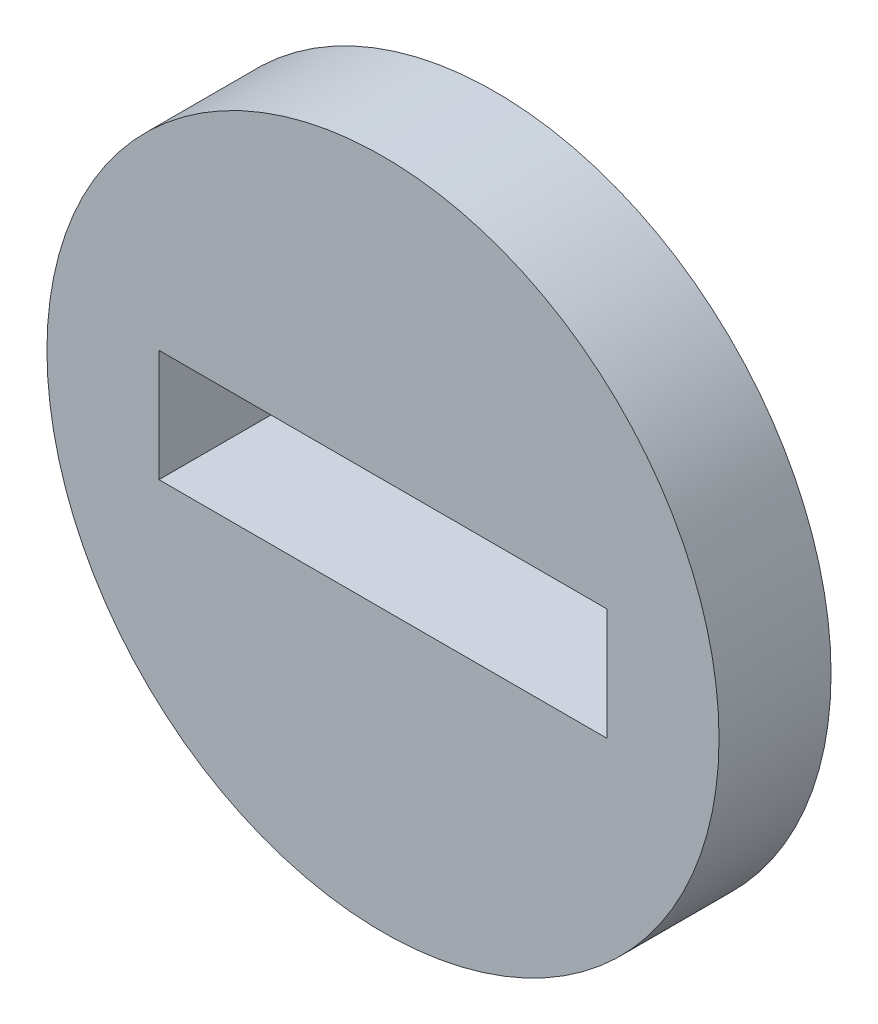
ISO-10303-21;
HEADER;
FILE_DESCRIPTION(('STEP AP214'),'2;1');
FILE_NAME('part.step','',(''),(''),'','','');
FILE_SCHEMA(('AUTOMOTIVE_DESIGN { 1 0 10303 214 1 1 1 1 }'));
ENDSEC;
DATA;
#1=APPLICATION_CONTEXT('core data for automotive mechanical design processes');
#2=APPLICATION_PROTOCOL_DEFINITION('international standard','automotive_design',2000,#1);
#3=PRODUCT_CONTEXT('',#1,'mechanical');
#4=PRODUCT('Part','Part','',(#3));
#5=PRODUCT_RELATED_PRODUCT_CATEGORY('part','',(#4));
#6=PRODUCT_DEFINITION_FORMATION('','',#4);
#7=PRODUCT_DEFINITION_CONTEXT('part definition',#1,'design');
#8=PRODUCT_DEFINITION('design','',#6,#7);
#9=PRODUCT_DEFINITION_SHAPE('','',#8);
#10=(LENGTH_UNIT() NAMED_UNIT(*) SI_UNIT(.MILLI.,.METRE.));
#11=(NAMED_UNIT(*) PLANE_ANGLE_UNIT() SI_UNIT($,.RADIAN.));
#12=(NAMED_UNIT(*) SI_UNIT($,.STERADIAN.) SOLID_ANGLE_UNIT());
#13=UNCERTAINTY_MEASURE_WITH_UNIT(LENGTH_MEASURE(1.E-05),#10,'distance_accuracy_value','');
#14=(GEOMETRIC_REPRESENTATION_CONTEXT(3) GLOBAL_UNCERTAINTY_ASSIGNED_CONTEXT((#13)) GLOBAL_UNIT_ASSIGNED_CONTEXT((#10,
#11,#12)) REPRESENTATION_CONTEXT('',''));
#15=CARTESIAN_POINT('',(0.,0.,0.));
#16=DIRECTION('',(0.,0.,1.));
#17=DIRECTION('',(1.,0.,0.));
#18=AXIS2_PLACEMENT_3D('',#15,#16,#17);
#19=CARTESIAN_POINT('',(0.,0.,6.35));
#20=DIRECTION('',(0.,0.,-1.));
#21=DIRECTION('',(-1.,0.,0.));
#22=AXIS2_PLACEMENT_3D('',#19,#20,#21);
#23=CYLINDRICAL_SURFACE('',#22,19.05);
#24=CARTESIAN_POINT('',(0.,0.,6.35));
#25=DIRECTION('',(0.,0.,1.));
#26=DIRECTION('',(1.,0.,0.));
#27=AXIS2_PLACEMENT_3D('',#24,#25,#26);
#28=CIRCLE('',#27,19.05);
#29=CARTESIAN_POINT('',(19.05,0.,6.35));
#30=VERTEX_POINT('',#29);
#31=EDGE_CURVE('E11',#30,#30,#28,.T.);
#32=ORIENTED_EDGE('',*,*,#31,.F.);
#33=EDGE_LOOP('',(#32));
#34=FACE_BOUND('',#33,.T.);
#35=CARTESIAN_POINT('',(0.,0.,0.));
#36=DIRECTION('',(0.,0.,1.));
#37=DIRECTION('',(1.,0.,0.));
#38=AXIS2_PLACEMENT_3D('',#35,#36,#37);
#39=CIRCLE('',#38,19.05);
#40=CARTESIAN_POINT('',(19.05,0.,0.));
#41=VERTEX_POINT('',#40);
#42=EDGE_CURVE('E38',#41,#41,#39,.T.);
#43=ORIENTED_EDGE('',*,*,#42,.T.);
#44=EDGE_LOOP('',(#43));
#45=FACE_BOUND('',#44,.T.);
#46=ADVANCED_FACE('F31',(#34,#45),#23,.T.);
#47=CARTESIAN_POINT('',(0.,0.,6.35));
#48=DIRECTION('',(0.,0.,1.));
#49=DIRECTION('',(1.,0.,0.));
#50=AXIS2_PLACEMENT_3D('',#47,#48,#49);
#51=PLANE('',#50);
#52=DIRECTION('',(0.,-1.,0.));
#53=VECTOR('',#52,1.);
#54=CARTESIAN_POINT('',(-12.7,3.175,6.35));
#55=LINE('',#54,#53);
#56=CARTESIAN_POINT('',(-12.7,3.175,6.35));
#57=VERTEX_POINT('',#56);
#58=CARTESIAN_POINT('',(-12.7,-3.175,6.35));
#59=VERTEX_POINT('',#58);
#60=EDGE_CURVE('E45',#57,#59,#55,.T.);
#61=ORIENTED_EDGE('',*,*,#60,.F.);
#62=DIRECTION('',(-1.,0.,0.));
#63=VECTOR('',#62,1.);
#64=CARTESIAN_POINT('',(-12.7,3.175,6.35));
#65=LINE('',#64,#63);
#66=CARTESIAN_POINT('',(12.7,3.175,6.35));
#67=VERTEX_POINT('',#66);
#68=EDGE_CURVE('E89',#67,#57,#65,.T.);
#69=ORIENTED_EDGE('',*,*,#68,.F.);
#70=DIRECTION('',(0.,1.,0.));
#71=VECTOR('',#70,1.);
#72=CARTESIAN_POINT('',(12.7,3.175,6.35));
#73=LINE('',#72,#71);
#74=CARTESIAN_POINT('',(12.7,-3.175,6.35));
#75=VERTEX_POINT('',#74);
#76=EDGE_CURVE('E73',#75,#67,#73,.T.);
#77=ORIENTED_EDGE('',*,*,#76,.F.);
#78=DIRECTION('',(1.,0.,0.));
#79=VECTOR('',#78,1.);
#80=CARTESIAN_POINT('',(-12.7,-3.175,6.35));
#81=LINE('',#80,#79);
#82=EDGE_CURVE('E82',#59,#75,#81,.T.);
#83=ORIENTED_EDGE('',*,*,#82,.F.);
#84=EDGE_LOOP('',(#61,#69,#77,#83));
#85=FACE_BOUND('',#84,.T.);
#86=ORIENTED_EDGE('',*,*,#31,.T.);
#87=EDGE_LOOP('',(#86));
#88=FACE_BOUND('',#87,.T.);
#89=ADVANCED_FACE('F86',(#85,#88),#51,.T.);
#90=CARTESIAN_POINT('',(0.,0.,0.));
#91=DIRECTION('',(0.,0.,1.));
#92=DIRECTION('',(1.,0.,0.));
#93=AXIS2_PLACEMENT_3D('',#90,#91,#92);
#94=PLANE('',#93);
#95=DIRECTION('',(-1.,0.,0.));
#96=VECTOR('',#95,1.);
#97=CARTESIAN_POINT('',(-12.7,3.175,0.));
#98=LINE('',#97,#96);
#99=CARTESIAN_POINT('',(12.7,3.175,0.));
#100=VERTEX_POINT('',#99);
#101=CARTESIAN_POINT('',(-12.7,3.175,0.));
#102=VERTEX_POINT('',#101);
#103=EDGE_CURVE('E100',#100,#102,#98,.T.);
#104=ORIENTED_EDGE('',*,*,#103,.T.);
#105=DIRECTION('',(0.,-1.,0.));
#106=VECTOR('',#105,1.);
#107=CARTESIAN_POINT('',(-12.7,3.175,0.));
#108=LINE('',#107,#106);
#109=CARTESIAN_POINT('',(-12.7,-3.175,0.));
#110=VERTEX_POINT('',#109);
#111=EDGE_CURVE('E91',#102,#110,#108,.T.);
#112=ORIENTED_EDGE('',*,*,#111,.T.);
#113=DIRECTION('',(1.,0.,0.));
#114=VECTOR('',#113,1.);
#115=CARTESIAN_POINT('',(-12.7,-3.175,0.));
#116=LINE('',#115,#114);
#117=CARTESIAN_POINT('',(12.7,-3.175,0.));
#118=VERTEX_POINT('',#117);
#119=EDGE_CURVE('E97',#110,#118,#116,.T.);
#120=ORIENTED_EDGE('',*,*,#119,.T.);
#121=DIRECTION('',(0.,1.,0.));
#122=VECTOR('',#121,1.);
#123=CARTESIAN_POINT('',(12.7,3.175,0.));
#124=LINE('',#123,#122);
#125=EDGE_CURVE('E53',#118,#100,#124,.T.);
#126=ORIENTED_EDGE('',*,*,#125,.T.);
#127=EDGE_LOOP('',(#104,#112,#120,#126));
#128=FACE_BOUND('',#127,.T.);
#129=ORIENTED_EDGE('',*,*,#42,.F.);
#130=EDGE_LOOP('',(#129));
#131=FACE_BOUND('',#130,.T.);
#132=ADVANCED_FACE('F110',(#128,#131),#94,.F.);
#133=CARTESIAN_POINT('',(-12.7,3.175,0.));
#134=DIRECTION('',(-1.,0.,0.));
#135=DIRECTION('',(0.,0.,1.));
#136=AXIS2_PLACEMENT_3D('',#133,#134,#135);
#137=PLANE('',#136);
#138=ORIENTED_EDGE('',*,*,#60,.T.);
#139=DIRECTION('',(0.,0.,1.));
#140=VECTOR('',#139,1.);
#141=CARTESIAN_POINT('',(-12.7,-3.175,0.));
#142=LINE('',#141,#140);
#143=EDGE_CURVE('E79',#110,#59,#142,.T.);
#144=ORIENTED_EDGE('',*,*,#143,.F.);
#145=ORIENTED_EDGE('',*,*,#111,.F.);
#146=DIRECTION('',(0.,0.,1.));
#147=VECTOR('',#146,1.);
#148=CARTESIAN_POINT('',(-12.7,3.175,0.));
#149=LINE('',#148,#147);
#150=EDGE_CURVE('E103',#102,#57,#149,.T.);
#151=ORIENTED_EDGE('',*,*,#150,.T.);
#152=EDGE_LOOP('',(#138,#144,#145,#151));
#153=FACE_BOUND('',#152,.T.);
#154=ADVANCED_FACE('F112',(#153),#137,.F.);
#155=CARTESIAN_POINT('',(-12.7,3.175,0.));
#156=DIRECTION('',(0.,1.,0.));
#157=DIRECTION('',(0.,0.,1.));
#158=AXIS2_PLACEMENT_3D('',#155,#156,#157);
#159=PLANE('',#158);
#160=ORIENTED_EDGE('',*,*,#68,.T.);
#161=ORIENTED_EDGE('',*,*,#150,.F.);
#162=ORIENTED_EDGE('',*,*,#103,.F.);
#163=DIRECTION('',(0.,0.,1.));
#164=VECTOR('',#163,1.);
#165=CARTESIAN_POINT('',(12.7,3.175,0.));
#166=LINE('',#165,#164);
#167=EDGE_CURVE('E78',#100,#67,#166,.T.);
#168=ORIENTED_EDGE('',*,*,#167,.T.);
#169=EDGE_LOOP('',(#160,#161,#162,#168));
#170=FACE_BOUND('',#169,.T.);
#171=ADVANCED_FACE('F119',(#170),#159,.F.);
#172=CARTESIAN_POINT('',(12.7,3.175,0.));
#173=DIRECTION('',(1.,0.,0.));
#174=DIRECTION('',(0.,0.,-1.));
#175=AXIS2_PLACEMENT_3D('',#172,#173,#174);
#176=PLANE('',#175);
#177=ORIENTED_EDGE('',*,*,#76,.T.);
#178=ORIENTED_EDGE('',*,*,#167,.F.);
#179=ORIENTED_EDGE('',*,*,#125,.F.);
#180=DIRECTION('',(0.,0.,1.));
#181=VECTOR('',#180,1.);
#182=CARTESIAN_POINT('',(12.7,-3.175,0.));
#183=LINE('',#182,#181);
#184=EDGE_CURVE('E69',#118,#75,#183,.T.);
#185=ORIENTED_EDGE('',*,*,#184,.T.);
#186=EDGE_LOOP('',(#177,#178,#179,#185));
#187=FACE_BOUND('',#186,.T.);
#188=ADVANCED_FACE('F71',(#187),#176,.F.);
#189=CARTESIAN_POINT('',(-12.7,-3.175,0.));
#190=DIRECTION('',(0.,-1.,0.));
#191=DIRECTION('',(0.,0.,-1.));
#192=AXIS2_PLACEMENT_3D('',#189,#190,#191);
#193=PLANE('',#192);
#194=ORIENTED_EDGE('',*,*,#82,.T.);
#195=ORIENTED_EDGE('',*,*,#184,.F.);
#196=ORIENTED_EDGE('',*,*,#119,.F.);
#197=ORIENTED_EDGE('',*,*,#143,.T.);
#198=EDGE_LOOP('',(#194,#195,#196,#197));
#199=FACE_BOUND('',#198,.T.);
#200=ADVANCED_FACE('F83',(#199),#193,.F.);
#201=CLOSED_SHELL('',(#46,#89,#132,#154,#171,#188,#200));
#202=MANIFOLD_SOLID_BREP('B2',#201);
#203=ADVANCED_BREP_SHAPE_REPRESENTATION('',(#18,#202),#14);
#204=SHAPE_DEFINITION_REPRESENTATION(#9,#203);
ENDSEC;
END-ISO-10303-21;
